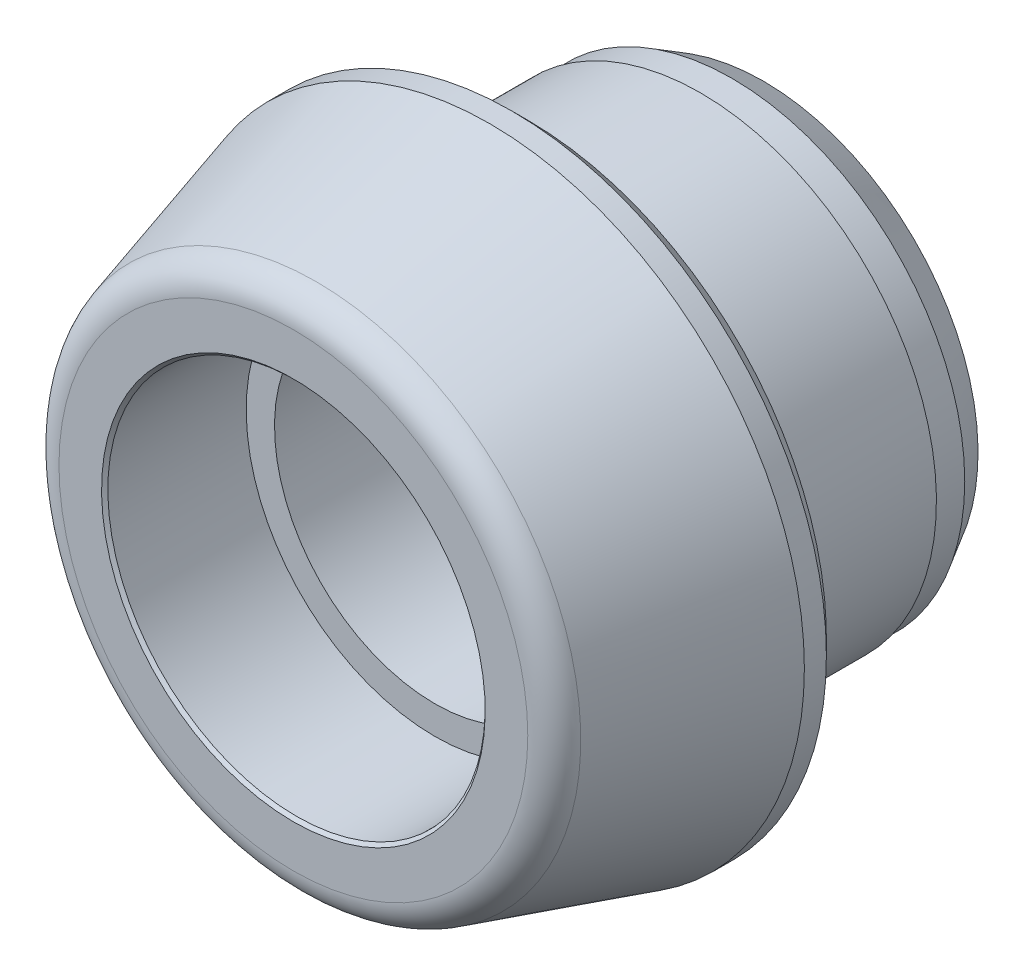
ISO-10303-21;
HEADER;
FILE_DESCRIPTION(('STEP AP214'),'2;1');
FILE_NAME('part.step','',(''),(''),'','','');
FILE_SCHEMA(('AUTOMOTIVE_DESIGN { 1 0 10303 214 1 1 1 1 }'));
ENDSEC;
DATA;
#1=APPLICATION_CONTEXT('core data for automotive mechanical design processes');
#2=APPLICATION_PROTOCOL_DEFINITION('international standard','automotive_design',2000,#1);
#3=PRODUCT_CONTEXT('',#1,'mechanical');
#4=PRODUCT('Part','Part','',(#3));
#5=PRODUCT_RELATED_PRODUCT_CATEGORY('part','',(#4));
#6=PRODUCT_DEFINITION_FORMATION('','',#4);
#7=PRODUCT_DEFINITION_CONTEXT('part definition',#1,'design');
#8=PRODUCT_DEFINITION('design','',#6,#7);
#9=PRODUCT_DEFINITION_SHAPE('','',#8);
#10=(LENGTH_UNIT() NAMED_UNIT(*) SI_UNIT(.MILLI.,.METRE.));
#11=(NAMED_UNIT(*) PLANE_ANGLE_UNIT() SI_UNIT($,.RADIAN.));
#12=(NAMED_UNIT(*) SI_UNIT($,.STERADIAN.) SOLID_ANGLE_UNIT());
#13=UNCERTAINTY_MEASURE_WITH_UNIT(LENGTH_MEASURE(1.E-05),#10,'distance_accuracy_value','');
#14=(GEOMETRIC_REPRESENTATION_CONTEXT(3) GLOBAL_UNCERTAINTY_ASSIGNED_CONTEXT((#13)) GLOBAL_UNIT_ASSIGNED_CONTEXT((#10,
#11,#12)) REPRESENTATION_CONTEXT('',''));
#15=CARTESIAN_POINT('',(0.,0.,0.));
#16=DIRECTION('',(0.,0.,1.));
#17=DIRECTION('',(1.,0.,0.));
#18=AXIS2_PLACEMENT_3D('',#15,#16,#17);
#19=CARTESIAN_POINT('',(0.,0.,7.45));
#20=DIRECTION('',(0.,0.,1.));
#21=DIRECTION('',(0.,-1.,0.));
#22=AXIS2_PLACEMENT_3D('',#19,#20,#21);
#23=CYLINDRICAL_SURFACE('',#22,5.1);
#24=CARTESIAN_POINT('',(0.,0.,-6.5));
#25=DIRECTION('',(0.,0.,-1.));
#26=DIRECTION('',(0.,1.,0.));
#27=AXIS2_PLACEMENT_3D('',#24,#25,#26);
#28=CIRCLE('',#27,5.1);
#29=CARTESIAN_POINT('',(0.,5.1,-6.5));
#30=VERTEX_POINT('',#29);
#31=EDGE_CURVE('E75',#30,#30,#28,.T.);
#32=ORIENTED_EDGE('',*,*,#31,.T.);
#33=EDGE_LOOP('',(#32));
#34=FACE_BOUND('',#33,.T.);
#35=CARTESIAN_POINT('',(0.,0.,2.95));
#36=DIRECTION('',(0.,0.,1.));
#37=DIRECTION('',(0.,-1.,0.));
#38=AXIS2_PLACEMENT_3D('',#35,#36,#37);
#39=CIRCLE('',#38,5.1);
#40=CARTESIAN_POINT('',(0.,-5.1,2.95));
#41=VERTEX_POINT('',#40);
#42=EDGE_CURVE('E16',#41,#41,#39,.F.);
#43=ORIENTED_EDGE('',*,*,#42,.F.);
#44=EDGE_LOOP('',(#43));
#45=FACE_BOUND('',#44,.T.);
#46=ADVANCED_FACE('F12',(#34,#45),#23,.F.);
#47=CARTESIAN_POINT('',(0.,0.,-7.5));
#48=DIRECTION('',(0.,0.,-1.));
#49=DIRECTION('',(0.,1.,0.));
#50=AXIS2_PLACEMENT_3D('',#47,#48,#49);
#51=CYLINDRICAL_SURFACE('',#50,7.5);
#52=CARTESIAN_POINT('',(0.,0.,-5.5));
#53=DIRECTION('',(0.,0.,-1.));
#54=DIRECTION('',(0.,1.,0.));
#55=AXIS2_PLACEMENT_3D('',#52,#53,#54);
#56=CIRCLE('',#55,7.5);
#57=CARTESIAN_POINT('',(0.,7.5,-5.5));
#58=VERTEX_POINT('',#57);
#59=EDGE_CURVE('E54',#58,#58,#56,.T.);
#60=ORIENTED_EDGE('',*,*,#59,.F.);
#61=EDGE_LOOP('',(#60));
#62=FACE_BOUND('',#61,.T.);
#63=CARTESIAN_POINT('',(0.,0.,-1.2));
#64=DIRECTION('',(0.,0.,-1.));
#65=DIRECTION('',(0.,1.,0.));
#66=AXIS2_PLACEMENT_3D('',#63,#64,#65);
#67=CIRCLE('',#66,7.5);
#68=CARTESIAN_POINT('',(0.,7.5,-1.2));
#69=VERTEX_POINT('',#68);
#70=EDGE_CURVE('E51',#69,#69,#67,.T.);
#71=ORIENTED_EDGE('',*,*,#70,.T.);
#72=EDGE_LOOP('',(#71));
#73=FACE_BOUND('',#72,.T.);
#74=ADVANCED_FACE('F95',(#62,#73),#51,.T.);
#75=CARTESIAN_POINT('',(10.,0.,0.));
#76=DIRECTION('',(0.,0.,-1.));
#77=DIRECTION('',(0.,1.,0.));
#78=AXIS2_PLACEMENT_3D('',#75,#76,#77);
#79=PLANE('',#78);
#80=CARTESIAN_POINT('',(0.,0.,0.));
#81=DIRECTION('',(0.,0.,-1.));
#82=DIRECTION('',(0.,1.,0.));
#83=AXIS2_PLACEMENT_3D('',#80,#81,#82);
#84=CIRCLE('',#83,9.5);
#85=CARTESIAN_POINT('',(0.,9.5,0.));
#86=VERTEX_POINT('',#85);
#87=EDGE_CURVE('E20',#86,#86,#84,.T.);
#88=ORIENTED_EDGE('',*,*,#87,.T.);
#89=EDGE_LOOP('',(#88));
#90=FACE_BOUND('',#89,.T.);
#91=CARTESIAN_POINT('',(0.,0.,0.));
#92=DIRECTION('',(0.,0.,-1.));
#93=DIRECTION('',(0.,1.,0.));
#94=AXIS2_PLACEMENT_3D('',#91,#92,#93);
#95=CIRCLE('',#94,8.3);
#96=CARTESIAN_POINT('',(0.,8.3,0.));
#97=VERTEX_POINT('',#96);
#98=EDGE_CURVE('E34',#97,#97,#95,.T.);
#99=ORIENTED_EDGE('',*,*,#98,.F.);
#100=EDGE_LOOP('',(#99));
#101=FACE_BOUND('',#100,.T.);
#102=ADVANCED_FACE('F138',(#90,#101),#79,.T.);
#103=CARTESIAN_POINT('',(0.,0.,7.45));
#104=DIRECTION('',(0.,0.,1.));
#105=DIRECTION('',(0.,-1.,0.));
#106=AXIS2_PLACEMENT_3D('',#103,#104,#105);
#107=PLANE('',#106);
#108=CARTESIAN_POINT('',(0.,0.,7.45));
#109=DIRECTION('',(0.,0.,1.));
#110=DIRECTION('',(0.,-1.,0.));
#111=AXIS2_PLACEMENT_3D('',#108,#109,#110);
#112=CIRCLE('',#111,6.1);
#113=CARTESIAN_POINT('',(0.,-6.1,7.45));
#114=VERTEX_POINT('',#113);
#115=EDGE_CURVE('E78',#114,#114,#112,.F.);
#116=ORIENTED_EDGE('',*,*,#115,.T.);
#117=EDGE_LOOP('',(#116));
#118=FACE_BOUND('',#117,.T.);
#119=CARTESIAN_POINT('',(0.,0.,7.45));
#120=DIRECTION('',(0.,0.,1.));
#121=DIRECTION('',(0.,-1.,0.));
#122=AXIS2_PLACEMENT_3D('',#119,#120,#121);
#123=CIRCLE('',#122,7.4542872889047);
#124=CARTESIAN_POINT('',(0.,-7.4542872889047,7.45));
#125=VERTEX_POINT('',#124);
#126=EDGE_CURVE('E66',#125,#125,#123,.T.);
#127=ORIENTED_EDGE('',*,*,#126,.T.);
#128=EDGE_LOOP('',(#127));
#129=FACE_BOUND('',#128,.T.);
#130=ADVANCED_FACE('F142',(#118,#129),#107,.T.);
#131=CARTESIAN_POINT('',(0.,0.,1.2));
#132=DIRECTION('',(0.,0.,-1.));
#133=DIRECTION('',(0.,1.,0.));
#134=AXIS2_PLACEMENT_3D('',#131,#132,#133);
#135=CONICAL_SURFACE('',#134,10.,0.279252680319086);
#136=CARTESIAN_POINT('',(0.,0.,6.72563735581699));
#137=DIRECTION('',(0.,0.,1.));
#138=DIRECTION('',(0.,-1.,0.));
#139=AXIS2_PLACEMENT_3D('',#136,#137,#138);
#140=CIRCLE('',#139,8.41554898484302);
#141=CARTESIAN_POINT('',(0.,-8.41554898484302,6.72563735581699));
#142=VERTEX_POINT('',#141);
#143=EDGE_CURVE('E63',#142,#142,#140,.F.);
#144=ORIENTED_EDGE('',*,*,#143,.T.);
#145=EDGE_LOOP('',(#144));
#146=FACE_BOUND('',#145,.T.);
#147=CARTESIAN_POINT('',(0.,0.,1.2));
#148=DIRECTION('',(0.,0.,-1.));
#149=DIRECTION('',(0.,1.,0.));
#150=AXIS2_PLACEMENT_3D('',#147,#148,#149);
#151=CIRCLE('',#150,10.);
#152=CARTESIAN_POINT('',(0.,10.,1.2));
#153=VERTEX_POINT('',#152);
#154=EDGE_CURVE('E60',#153,#153,#151,.T.);
#155=ORIENTED_EDGE('',*,*,#154,.F.);
#156=EDGE_LOOP('',(#155));
#157=FACE_BOUND('',#156,.T.);
#158=ADVANCED_FACE('F146',(#146,#157),#135,.T.);
#159=CARTESIAN_POINT('',(0.,0.,-7.5));
#160=DIRECTION('',(0.,0.,-1.));
#161=DIRECTION('',(0.,1.,0.));
#162=AXIS2_PLACEMENT_3D('',#159,#160,#161);
#163=CYLINDRICAL_SURFACE('',#162,10.);
#164=CARTESIAN_POINT('',(0.,0.,0.5));
#165=DIRECTION('',(0.,0.,-1.));
#166=DIRECTION('',(0.,1.,0.));
#167=AXIS2_PLACEMENT_3D('',#164,#165,#166);
#168=CIRCLE('',#167,10.);
#169=CARTESIAN_POINT('',(0.,10.,0.5));
#170=VERTEX_POINT('',#169);
#171=EDGE_CURVE('E8',#170,#170,#168,.F.);
#172=ORIENTED_EDGE('',*,*,#171,.T.);
#173=EDGE_LOOP('',(#172));
#174=FACE_BOUND('',#173,.T.);
#175=ORIENTED_EDGE('',*,*,#154,.T.);
#176=EDGE_LOOP('',(#175));
#177=FACE_BOUND('',#176,.T.);
#178=ADVANCED_FACE('F134',(#174,#177),#163,.T.);
#179=CARTESIAN_POINT('',(0.,0.,-7.5));
#180=DIRECTION('',(0.,0.,-1.));
#181=DIRECTION('',(0.,1.,0.));
#182=AXIS2_PLACEMENT_3D('',#179,#180,#181);
#183=CYLINDRICAL_SURFACE('',#182,7.4);
#184=CARTESIAN_POINT('',(0.,0.,-6.5));
#185=DIRECTION('',(0.,0.,-1.));
#186=DIRECTION('',(0.,1.,0.));
#187=AXIS2_PLACEMENT_3D('',#184,#185,#186);
#188=CIRCLE('',#187,7.4);
#189=CARTESIAN_POINT('',(0.,7.4,-6.5));
#190=VERTEX_POINT('',#189);
#191=EDGE_CURVE('E72',#190,#190,#188,.F.);
#192=ORIENTED_EDGE('',*,*,#191,.T.);
#193=EDGE_LOOP('',(#192));
#194=FACE_BOUND('',#193,.T.);
#195=CARTESIAN_POINT('',(0.,0.,-5.5));
#196=DIRECTION('',(0.,0.,-1.));
#197=DIRECTION('',(0.,1.,0.));
#198=AXIS2_PLACEMENT_3D('',#195,#196,#197);
#199=CIRCLE('',#198,7.4);
#200=CARTESIAN_POINT('',(0.,7.4,-5.5));
#201=VERTEX_POINT('',#200);
#202=EDGE_CURVE('E57',#201,#201,#199,.T.);
#203=ORIENTED_EDGE('',*,*,#202,.T.);
#204=EDGE_LOOP('',(#203));
#205=FACE_BOUND('',#204,.T.);
#206=ADVANCED_FACE('F130',(#194,#205),#183,.T.);
#207=CARTESIAN_POINT('',(-7.4,0.,-5.5));
#208=DIRECTION('',(0.,0.,-1.));
#209=DIRECTION('',(0.,1.,0.));
#210=AXIS2_PLACEMENT_3D('',#207,#208,#209);
#211=PLANE('',#210);
#212=ORIENTED_EDGE('',*,*,#59,.T.);
#213=EDGE_LOOP('',(#212));
#214=FACE_BOUND('',#213,.T.);
#215=ORIENTED_EDGE('',*,*,#202,.F.);
#216=EDGE_LOOP('',(#215));
#217=FACE_BOUND('',#216,.T.);
#218=ADVANCED_FACE('F127',(#214,#217),#211,.T.);
#219=CARTESIAN_POINT('',(7.5,0.,-7.5));
#220=DIRECTION('',(0.,0.,-1.));
#221=DIRECTION('',(0.,1.,0.));
#222=AXIS2_PLACEMENT_3D('',#219,#220,#221);
#223=PLANE('',#222);
#224=CARTESIAN_POINT('',(0.,0.,-7.5));
#225=DIRECTION('',(0.,0.,-1.));
#226=DIRECTION('',(0.,1.,0.));
#227=AXIS2_PLACEMENT_3D('',#224,#225,#226);
#228=CIRCLE('',#227,6.1);
#229=CARTESIAN_POINT('',(0.,6.1,-7.5));
#230=VERTEX_POINT('',#229);
#231=EDGE_CURVE('E25',#230,#230,#228,.F.);
#232=ORIENTED_EDGE('',*,*,#231,.T.);
#233=EDGE_LOOP('',(#232));
#234=FACE_BOUND('',#233,.T.);
#235=CARTESIAN_POINT('',(0.,0.,-7.5));
#236=DIRECTION('',(0.,0.,-1.));
#237=DIRECTION('',(0.,1.,0.));
#238=AXIS2_PLACEMENT_3D('',#235,#236,#237);
#239=CIRCLE('',#238,6.82264973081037);
#240=CARTESIAN_POINT('',(0.,6.82264973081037,-7.5));
#241=VERTEX_POINT('',#240);
#242=EDGE_CURVE('E69',#241,#241,#239,.T.);
#243=ORIENTED_EDGE('',*,*,#242,.T.);
#244=EDGE_LOOP('',(#243));
#245=FACE_BOUND('',#244,.T.);
#246=ADVANCED_FACE('F83',(#234,#245),#223,.T.);
#247=CARTESIAN_POINT('',(0.,0.,6.45));
#248=DIRECTION('',(0.,0.,1.));
#249=DIRECTION('',(0.,-1.,0.));
#250=AXIS2_PLACEMENT_3D('',#247,#248,#249);
#251=TOROIDAL_SURFACE('',#250,7.4542872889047,1.);
#252=ORIENTED_EDGE('',*,*,#126,.F.);
#253=EDGE_LOOP('',(#252));
#254=FACE_BOUND('',#253,.T.);
#255=ORIENTED_EDGE('',*,*,#143,.F.);
#256=EDGE_LOOP('',(#255));
#257=FACE_BOUND('',#256,.T.);
#258=ADVANCED_FACE('F155',(#254,#257),#251,.T.);
#259=CARTESIAN_POINT('',(0.,0.,-7.5));
#260=DIRECTION('',(0.,0.,1.));
#261=DIRECTION('',(0.,-1.,0.));
#262=AXIS2_PLACEMENT_3D('',#259,#260,#261);
#263=CONICAL_SURFACE('',#262,6.82264973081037,0.523598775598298);
#264=ORIENTED_EDGE('',*,*,#191,.F.);
#265=EDGE_LOOP('',(#264));
#266=FACE_BOUND('',#265,.T.);
#267=ORIENTED_EDGE('',*,*,#242,.F.);
#268=EDGE_LOOP('',(#267));
#269=FACE_BOUND('',#268,.T.);
#270=ADVANCED_FACE('F158',(#266,#269),#263,.T.);
#271=CARTESIAN_POINT('',(0.,0.,6.45));
#272=DIRECTION('',(0.,0.,1.));
#273=DIRECTION('',(0.,-1.,0.));
#274=AXIS2_PLACEMENT_3D('',#271,#272,#273);
#275=CONICAL_SURFACE('',#274,5.1,0.78539816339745);
#276=CARTESIAN_POINT('',(0.,0.,7.35));
#277=DIRECTION('',(0.,0.,1.));
#278=DIRECTION('',(0.,-1.,0.));
#279=AXIS2_PLACEMENT_3D('',#276,#277,#278);
#280=CIRCLE('',#279,6.);
#281=CARTESIAN_POINT('',(0.,-6.,7.35));
#282=VERTEX_POINT('',#281);
#283=EDGE_CURVE('E28',#282,#282,#280,.T.);
#284=ORIENTED_EDGE('',*,*,#283,.F.);
#285=EDGE_LOOP('',(#284));
#286=FACE_BOUND('',#285,.T.);
#287=ORIENTED_EDGE('',*,*,#115,.F.);
#288=EDGE_LOOP('',(#287));
#289=FACE_BOUND('',#288,.T.);
#290=ADVANCED_FACE('F90',(#286,#289),#275,.F.);
#291=CARTESIAN_POINT('',(0.,0.,-6.5));
#292=DIRECTION('',(0.,0.,-1.));
#293=DIRECTION('',(0.,1.,0.));
#294=AXIS2_PLACEMENT_3D('',#291,#292,#293);
#295=CONICAL_SURFACE('',#294,5.1,0.78539816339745);
#296=ORIENTED_EDGE('',*,*,#231,.F.);
#297=EDGE_LOOP('',(#296));
#298=FACE_BOUND('',#297,.T.);
#299=ORIENTED_EDGE('',*,*,#31,.F.);
#300=EDGE_LOOP('',(#299));
#301=FACE_BOUND('',#300,.T.);
#302=ADVANCED_FACE('F86',(#298,#301),#295,.F.);
#303=CARTESIAN_POINT('',(0.,0.,-1.2));
#304=DIRECTION('',(0.,0.,-1.));
#305=DIRECTION('',(0.,1.,0.));
#306=AXIS2_PLACEMENT_3D('',#303,#304,#305);
#307=CONICAL_SURFACE('',#306,7.5,0.523598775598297);
#308=CARTESIAN_POINT('',(0.,0.,-0.333974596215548));
#309=DIRECTION('',(0.,0.,-1.));
#310=DIRECTION('',(0.,1.,0.));
#311=AXIS2_PLACEMENT_3D('',#308,#309,#310);
#312=CIRCLE('',#311,7.);
#313=CARTESIAN_POINT('',(0.,7.,-0.333974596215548));
#314=VERTEX_POINT('',#313);
#315=EDGE_CURVE('E48',#314,#314,#312,.T.);
#316=ORIENTED_EDGE('',*,*,#315,.T.);
#317=EDGE_LOOP('',(#316));
#318=FACE_BOUND('',#317,.T.);
#319=ORIENTED_EDGE('',*,*,#70,.F.);
#320=EDGE_LOOP('',(#319));
#321=FACE_BOUND('',#320,.T.);
#322=ADVANCED_FACE('F89',(#318,#321),#307,.T.);
#323=CARTESIAN_POINT('',(0.,0.,-7.5));
#324=DIRECTION('',(0.,0.,-1.));
#325=DIRECTION('',(0.,1.,0.));
#326=AXIS2_PLACEMENT_3D('',#323,#324,#325);
#327=CYLINDRICAL_SURFACE('',#326,7.);
#328=CARTESIAN_POINT('',(0.,0.,0.1));
#329=DIRECTION('',(0.,0.,-1.));
#330=DIRECTION('',(0.,1.,0.));
#331=AXIS2_PLACEMENT_3D('',#328,#329,#330);
#332=CIRCLE('',#331,7.);
#333=CARTESIAN_POINT('',(0.,7.,0.1));
#334=VERTEX_POINT('',#333);
#335=EDGE_CURVE('E45',#334,#334,#332,.T.);
#336=ORIENTED_EDGE('',*,*,#335,.T.);
#337=EDGE_LOOP('',(#336));
#338=FACE_BOUND('',#337,.T.);
#339=ORIENTED_EDGE('',*,*,#315,.F.);
#340=EDGE_LOOP('',(#339));
#341=FACE_BOUND('',#340,.T.);
#342=ADVANCED_FACE('F119',(#338,#341),#327,.T.);
#343=CARTESIAN_POINT('',(0.,0.,0.1));
#344=DIRECTION('',(0.,0.,-1.));
#345=DIRECTION('',(0.,1.,0.));
#346=AXIS2_PLACEMENT_3D('',#343,#344,#345);
#347=TOROIDAL_SURFACE('',#346,7.4,0.4);
#348=CARTESIAN_POINT('',(0.,0.,0.437152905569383));
#349=DIRECTION('',(0.,0.,-1.));
#350=DIRECTION('',(0.,1.,0.));
#351=AXIS2_PLACEMENT_3D('',#348,#349,#350);
#352=CIRCLE('',#351,7.61523921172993);
#353=CARTESIAN_POINT('',(0.,7.61523921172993,0.437152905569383));
#354=VERTEX_POINT('',#353);
#355=EDGE_CURVE('E42',#354,#354,#352,.T.);
#356=ORIENTED_EDGE('',*,*,#355,.T.);
#357=EDGE_LOOP('',(#356));
#358=FACE_BOUND('',#357,.T.);
#359=ORIENTED_EDGE('',*,*,#335,.F.);
#360=EDGE_LOOP('',(#359));
#361=FACE_BOUND('',#360,.T.);
#362=ADVANCED_FACE('F115',(#358,#361),#347,.F.);
#363=CARTESIAN_POINT('',(0.,0.,0.437152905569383));
#364=DIRECTION('',(0.,0.,-1.));
#365=DIRECTION('',(0.,1.,0.));
#366=AXIS2_PLACEMENT_3D('',#363,#364,#365);
#367=CONICAL_SURFACE('',#366,7.61523921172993,1.00261735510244);
#368=ORIENTED_EDGE('',*,*,#98,.T.);
#369=EDGE_LOOP('',(#368));
#370=FACE_BOUND('',#369,.T.);
#371=ORIENTED_EDGE('',*,*,#355,.F.);
#372=EDGE_LOOP('',(#371));
#373=FACE_BOUND('',#372,.T.);
#374=ADVANCED_FACE('F110',(#370,#373),#367,.F.);
#375=CARTESIAN_POINT('',(0.,0.,0.));
#376=DIRECTION('',(0.,0.,1.));
#377=DIRECTION('',(0.,-1.,0.));
#378=AXIS2_PLACEMENT_3D('',#375,#376,#377);
#379=CONICAL_SURFACE('',#378,9.5,0.785398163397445);
#380=ORIENTED_EDGE('',*,*,#171,.F.);
#381=EDGE_LOOP('',(#380));
#382=FACE_BOUND('',#381,.T.);
#383=ORIENTED_EDGE('',*,*,#87,.F.);
#384=EDGE_LOOP('',(#383));
#385=FACE_BOUND('',#384,.T.);
#386=ADVANCED_FACE('F14',(#382,#385),#379,.T.);
#387=CARTESIAN_POINT('',(0.,0.,2.95));
#388=DIRECTION('',(0.,0.,1.));
#389=DIRECTION('',(0.,-1.,0.));
#390=AXIS2_PLACEMENT_3D('',#387,#388,#389);
#391=PLANE('',#390);
#392=CARTESIAN_POINT('',(0.,0.,2.95));
#393=DIRECTION('',(0.,0.,1.));
#394=DIRECTION('',(0.,-1.,0.));
#395=AXIS2_PLACEMENT_3D('',#392,#393,#394);
#396=CIRCLE('',#395,6.);
#397=CARTESIAN_POINT('',(0.,-6.,2.95));
#398=VERTEX_POINT('',#397);
#399=EDGE_CURVE('E30',#398,#398,#396,.T.);
#400=ORIENTED_EDGE('',*,*,#399,.T.);
#401=EDGE_LOOP('',(#400));
#402=FACE_BOUND('',#401,.T.);
#403=ORIENTED_EDGE('',*,*,#42,.T.);
#404=EDGE_LOOP('',(#403));
#405=FACE_BOUND('',#404,.T.);
#406=ADVANCED_FACE('F99',(#402,#405),#391,.T.);
#407=CARTESIAN_POINT('',(0.,0.,2.95));
#408=DIRECTION('',(0.,0.,1.));
#409=DIRECTION('',(0.,-1.,0.));
#410=AXIS2_PLACEMENT_3D('',#407,#408,#409);
#411=CYLINDRICAL_SURFACE('',#410,6.);
#412=ORIENTED_EDGE('',*,*,#283,.T.);
#413=EDGE_LOOP('',(#412));
#414=FACE_BOUND('',#413,.T.);
#415=ORIENTED_EDGE('',*,*,#399,.F.);
#416=EDGE_LOOP('',(#415));
#417=FACE_BOUND('',#416,.T.);
#418=ADVANCED_FACE('F101',(#414,#417),#411,.F.);
#419=CLOSED_SHELL('',(#46,#74,#102,#130,#158,#178,#206,#218,#246,#258,#270,#290,#302,#322,#342,
#362,#374,#386,#406,#418));
#420=MANIFOLD_SOLID_BREP('B1',#419);
#421=ADVANCED_BREP_SHAPE_REPRESENTATION('',(#18,#420),#14);
#422=SHAPE_DEFINITION_REPRESENTATION(#9,#421);
ENDSEC;
END-ISO-10303-21;
